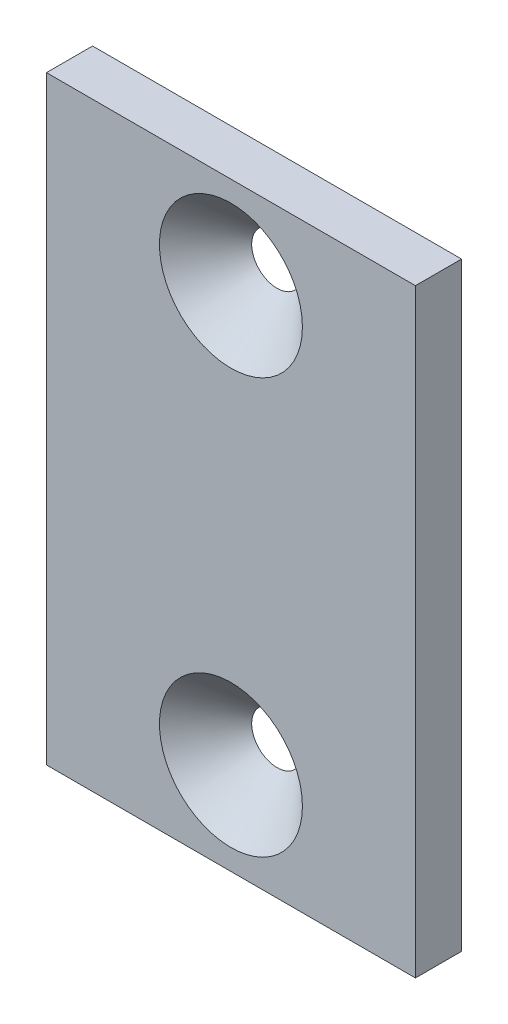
ISO-10303-21;
HEADER;
FILE_DESCRIPTION(('STEP AP214'),'2;1');
FILE_NAME('part.step','',(''),(''),'','','');
FILE_SCHEMA(('AUTOMOTIVE_DESIGN { 1 0 10303 214 1 1 1 1 }'));
ENDSEC;
DATA;
#1=APPLICATION_CONTEXT('core data for automotive mechanical design processes');
#2=APPLICATION_PROTOCOL_DEFINITION('international standard','automotive_design',2000,#1);
#3=PRODUCT_CONTEXT('',#1,'mechanical');
#4=PRODUCT('Part','Part','',(#3));
#5=PRODUCT_RELATED_PRODUCT_CATEGORY('part','',(#4));
#6=PRODUCT_DEFINITION_FORMATION('','',#4);
#7=PRODUCT_DEFINITION_CONTEXT('part definition',#1,'design');
#8=PRODUCT_DEFINITION('design','',#6,#7);
#9=PRODUCT_DEFINITION_SHAPE('','',#8);
#10=(LENGTH_UNIT() NAMED_UNIT(*) SI_UNIT(.MILLI.,.METRE.));
#11=(NAMED_UNIT(*) PLANE_ANGLE_UNIT() SI_UNIT($,.RADIAN.));
#12=(NAMED_UNIT(*) SI_UNIT($,.STERADIAN.) SOLID_ANGLE_UNIT());
#13=UNCERTAINTY_MEASURE_WITH_UNIT(LENGTH_MEASURE(1.E-05),#10,'distance_accuracy_value','');
#14=(GEOMETRIC_REPRESENTATION_CONTEXT(3) GLOBAL_UNCERTAINTY_ASSIGNED_CONTEXT((#13)) GLOBAL_UNIT_ASSIGNED_CONTEXT((#10,
#11,#12)) REPRESENTATION_CONTEXT('',''));
#15=CARTESIAN_POINT('',(0.,0.,0.));
#16=DIRECTION('',(0.,0.,1.));
#17=DIRECTION('',(1.,0.,0.));
#18=AXIS2_PLACEMENT_3D('',#15,#16,#17);
#19=CARTESIAN_POINT('',(0.,0.,5.));
#20=DIRECTION('',(0.,0.,1.));
#21=DIRECTION('',(1.,0.,0.));
#22=AXIS2_PLACEMENT_3D('',#19,#20,#21);
#23=PLANE('',#22);
#24=CARTESIAN_POINT('',(-20.,10.,5.));
#25=DIRECTION('',(0.,0.,1.));
#26=DIRECTION('',(1.,0.,0.));
#27=AXIS2_PLACEMENT_3D('',#24,#25,#26);
#28=CIRCLE('',#27,7.75000000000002);
#29=CARTESIAN_POINT('',(-12.25,10.,5.));
#30=VERTEX_POINT('',#29);
#31=EDGE_CURVE('E11',#30,#30,#28,.F.);
#32=ORIENTED_EDGE('',*,*,#31,.T.);
#33=EDGE_LOOP('',(#32));
#34=FACE_BOUND('',#33,.T.);
#35=CARTESIAN_POINT('',(-20.,55.,5.));
#36=DIRECTION('',(0.,0.,1.));
#37=DIRECTION('',(1.,0.,0.));
#38=AXIS2_PLACEMENT_3D('',#35,#36,#37);
#39=CIRCLE('',#38,7.75000000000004);
#40=CARTESIAN_POINT('',(-12.25,55.,5.));
#41=VERTEX_POINT('',#40);
#42=EDGE_CURVE('E52',#41,#41,#39,.F.);
#43=ORIENTED_EDGE('',*,*,#42,.T.);
#44=EDGE_LOOP('',(#43));
#45=FACE_BOUND('',#44,.T.);
#46=DIRECTION('',(0.,1.,0.));
#47=VECTOR('',#46,1.);
#48=CARTESIAN_POINT('',(0.,0.,5.));
#49=LINE('',#48,#47);
#50=CARTESIAN_POINT('',(0.,0.,5.));
#51=VERTEX_POINT('',#50);
#52=CARTESIAN_POINT('',(0.,65.,5.));
#53=VERTEX_POINT('',#52);
#54=EDGE_CURVE('E96',#51,#53,#49,.T.);
#55=ORIENTED_EDGE('',*,*,#54,.T.);
#56=DIRECTION('',(-1.,0.,0.));
#57=VECTOR('',#56,1.);
#58=CARTESIAN_POINT('',(0.,65.,5.));
#59=LINE('',#58,#57);
#60=CARTESIAN_POINT('',(-40.,65.,5.));
#61=VERTEX_POINT('',#60);
#62=EDGE_CURVE('E95',#53,#61,#59,.T.);
#63=ORIENTED_EDGE('',*,*,#62,.T.);
#64=DIRECTION('',(0.,-1.,0.));
#65=VECTOR('',#64,1.);
#66=CARTESIAN_POINT('',(-40.,0.,5.));
#67=LINE('',#66,#65);
#68=CARTESIAN_POINT('',(-40.,0.,5.));
#69=VERTEX_POINT('',#68);
#70=EDGE_CURVE('E94',#61,#69,#67,.T.);
#71=ORIENTED_EDGE('',*,*,#70,.T.);
#72=DIRECTION('',(1.,0.,0.));
#73=VECTOR('',#72,1.);
#74=CARTESIAN_POINT('',(0.,0.,5.));
#75=LINE('',#74,#73);
#76=EDGE_CURVE('E64',#69,#51,#75,.T.);
#77=ORIENTED_EDGE('',*,*,#76,.T.);
#78=EDGE_LOOP('',(#55,#63,#71,#77));
#79=FACE_BOUND('',#78,.T.);
#80=ADVANCED_FACE('F45',(#34,#45,#79),#23,.T.);
#81=CARTESIAN_POINT('',(0.,0.,0.));
#82=DIRECTION('',(0.,0.,1.));
#83=DIRECTION('',(1.,0.,0.));
#84=AXIS2_PLACEMENT_3D('',#81,#82,#83);
#85=PLANE('',#84);
#86=DIRECTION('',(0.,1.,0.));
#87=VECTOR('',#86,1.);
#88=CARTESIAN_POINT('',(0.,0.,0.));
#89=LINE('',#88,#87);
#90=CARTESIAN_POINT('',(0.,0.,0.));
#91=VERTEX_POINT('',#90);
#92=CARTESIAN_POINT('',(0.,65.,0.));
#93=VERTEX_POINT('',#92);
#94=EDGE_CURVE('E119',#91,#93,#89,.T.);
#95=ORIENTED_EDGE('',*,*,#94,.F.);
#96=DIRECTION('',(1.,0.,0.));
#97=VECTOR('',#96,1.);
#98=CARTESIAN_POINT('',(0.,0.,0.));
#99=LINE('',#98,#97);
#100=CARTESIAN_POINT('',(-40.,0.,0.));
#101=VERTEX_POINT('',#100);
#102=EDGE_CURVE('E84',#101,#91,#99,.T.);
#103=ORIENTED_EDGE('',*,*,#102,.F.);
#104=DIRECTION('',(0.,-1.,0.));
#105=VECTOR('',#104,1.);
#106=CARTESIAN_POINT('',(-40.,0.,0.));
#107=LINE('',#106,#105);
#108=CARTESIAN_POINT('',(-40.,65.,0.));
#109=VERTEX_POINT('',#108);
#110=EDGE_CURVE('E80',#109,#101,#107,.T.);
#111=ORIENTED_EDGE('',*,*,#110,.F.);
#112=DIRECTION('',(-1.,0.,0.));
#113=VECTOR('',#112,1.);
#114=CARTESIAN_POINT('',(0.,65.,0.));
#115=LINE('',#114,#113);
#116=EDGE_CURVE('E105',#93,#109,#115,.T.);
#117=ORIENTED_EDGE('',*,*,#116,.F.);
#118=EDGE_LOOP('',(#95,#103,#111,#117));
#119=FACE_BOUND('',#118,.T.);
#120=CARTESIAN_POINT('',(-20.,55.,0.));
#121=DIRECTION('',(0.,0.,1.));
#122=DIRECTION('',(1.,0.,0.));
#123=AXIS2_PLACEMENT_3D('',#120,#121,#122);
#124=CIRCLE('',#123,2.75);
#125=CARTESIAN_POINT('',(-17.25,55.,0.));
#126=VERTEX_POINT('',#125);
#127=EDGE_CURVE('E117',#126,#126,#124,.T.);
#128=ORIENTED_EDGE('',*,*,#127,.T.);
#129=EDGE_LOOP('',(#128));
#130=FACE_BOUND('',#129,.T.);
#131=CARTESIAN_POINT('',(-20.,10.,0.));
#132=DIRECTION('',(0.,0.,1.));
#133=DIRECTION('',(1.,0.,0.));
#134=AXIS2_PLACEMENT_3D('',#131,#132,#133);
#135=CIRCLE('',#134,2.75);
#136=CARTESIAN_POINT('',(-17.25,10.,0.));
#137=VERTEX_POINT('',#136);
#138=EDGE_CURVE('E144',#137,#137,#135,.T.);
#139=ORIENTED_EDGE('',*,*,#138,.T.);
#140=EDGE_LOOP('',(#139));
#141=FACE_BOUND('',#140,.T.);
#142=ADVANCED_FACE('F161',(#119,#130,#141),#85,.F.);
#143=CARTESIAN_POINT('',(0.,0.,5.));
#144=DIRECTION('',(-1.,0.,0.));
#145=DIRECTION('',(0.,0.,1.));
#146=AXIS2_PLACEMENT_3D('',#143,#144,#145);
#147=PLANE('',#146);
#148=ORIENTED_EDGE('',*,*,#94,.T.);
#149=DIRECTION('',(0.,0.,-1.));
#150=VECTOR('',#149,1.);
#151=CARTESIAN_POINT('',(0.,65.,5.));
#152=LINE('',#151,#150);
#153=EDGE_CURVE('E102',#53,#93,#152,.T.);
#154=ORIENTED_EDGE('',*,*,#153,.F.);
#155=ORIENTED_EDGE('',*,*,#54,.F.);
#156=DIRECTION('',(0.,0.,-1.));
#157=VECTOR('',#156,1.);
#158=CARTESIAN_POINT('',(0.,0.,5.));
#159=LINE('',#158,#157);
#160=EDGE_CURVE('E115',#51,#91,#159,.T.);
#161=ORIENTED_EDGE('',*,*,#160,.T.);
#162=EDGE_LOOP('',(#148,#154,#155,#161));
#163=FACE_BOUND('',#162,.T.);
#164=ADVANCED_FACE('F176',(#163),#147,.F.);
#165=CARTESIAN_POINT('',(0.,65.,5.));
#166=DIRECTION('',(0.,-1.,0.));
#167=DIRECTION('',(0.,0.,-1.));
#168=AXIS2_PLACEMENT_3D('',#165,#166,#167);
#169=PLANE('',#168);
#170=ORIENTED_EDGE('',*,*,#116,.T.);
#171=DIRECTION('',(0.,0.,-1.));
#172=VECTOR('',#171,1.);
#173=CARTESIAN_POINT('',(-40.,65.,5.));
#174=LINE('',#173,#172);
#175=EDGE_CURVE('E99',#61,#109,#174,.T.);
#176=ORIENTED_EDGE('',*,*,#175,.F.);
#177=ORIENTED_EDGE('',*,*,#62,.F.);
#178=ORIENTED_EDGE('',*,*,#153,.T.);
#179=EDGE_LOOP('',(#170,#176,#177,#178));
#180=FACE_BOUND('',#179,.T.);
#181=ADVANCED_FACE('F101',(#180),#169,.F.);
#182=CARTESIAN_POINT('',(-40.,0.,5.));
#183=DIRECTION('',(1.,0.,0.));
#184=DIRECTION('',(0.,1.,0.));
#185=AXIS2_PLACEMENT_3D('',#182,#183,#184);
#186=PLANE('',#185);
#187=ORIENTED_EDGE('',*,*,#110,.T.);
#188=DIRECTION('',(0.,0.,-1.));
#189=VECTOR('',#188,1.);
#190=CARTESIAN_POINT('',(-40.,0.,5.));
#191=LINE('',#190,#189);
#192=EDGE_CURVE('E104',#69,#101,#191,.T.);
#193=ORIENTED_EDGE('',*,*,#192,.F.);
#194=ORIENTED_EDGE('',*,*,#70,.F.);
#195=ORIENTED_EDGE('',*,*,#175,.T.);
#196=EDGE_LOOP('',(#187,#193,#194,#195));
#197=FACE_BOUND('',#196,.T.);
#198=ADVANCED_FACE('F110',(#197),#186,.F.);
#199=CARTESIAN_POINT('',(0.,0.,5.));
#200=DIRECTION('',(0.,1.,0.));
#201=DIRECTION('',(-1.,0.,0.));
#202=AXIS2_PLACEMENT_3D('',#199,#200,#201);
#203=PLANE('',#202);
#204=ORIENTED_EDGE('',*,*,#102,.T.);
#205=ORIENTED_EDGE('',*,*,#160,.F.);
#206=ORIENTED_EDGE('',*,*,#76,.F.);
#207=ORIENTED_EDGE('',*,*,#192,.T.);
#208=EDGE_LOOP('',(#204,#205,#206,#207));
#209=FACE_BOUND('',#208,.T.);
#210=ADVANCED_FACE('F163',(#209),#203,.F.);
#211=CARTESIAN_POINT('',(-20.,10.,0.));
#212=DIRECTION('',(0.,0.,1.));
#213=DIRECTION('',(1.,0.,0.));
#214=AXIS2_PLACEMENT_3D('',#211,#212,#213);
#215=CONICAL_SURFACE('',#214,2.75,0.78539816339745);
#216=ORIENTED_EDGE('',*,*,#31,.F.);
#217=EDGE_LOOP('',(#216));
#218=FACE_BOUND('',#217,.T.);
#219=ORIENTED_EDGE('',*,*,#138,.F.);
#220=EDGE_LOOP('',(#219));
#221=FACE_BOUND('',#220,.T.);
#222=ADVANCED_FACE('F137',(#218,#221),#215,.F.);
#223=CARTESIAN_POINT('',(-20.,55.,0.));
#224=DIRECTION('',(0.,0.,1.));
#225=DIRECTION('',(1.,0.,0.));
#226=AXIS2_PLACEMENT_3D('',#223,#224,#225);
#227=CONICAL_SURFACE('',#226,2.75,0.78539816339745);
#228=ORIENTED_EDGE('',*,*,#42,.F.);
#229=EDGE_LOOP('',(#228));
#230=FACE_BOUND('',#229,.T.);
#231=ORIENTED_EDGE('',*,*,#127,.F.);
#232=EDGE_LOOP('',(#231));
#233=FACE_BOUND('',#232,.T.);
#234=ADVANCED_FACE('F44',(#230,#233),#227,.F.);
#235=CLOSED_SHELL('',(#80,#142,#164,#181,#198,#210,#222,#234));
#236=MANIFOLD_SOLID_BREP('B2',#235);
#237=ADVANCED_BREP_SHAPE_REPRESENTATION('',(#18,#236),#14);
#238=SHAPE_DEFINITION_REPRESENTATION(#9,#237);
ENDSEC;
END-ISO-10303-21;
